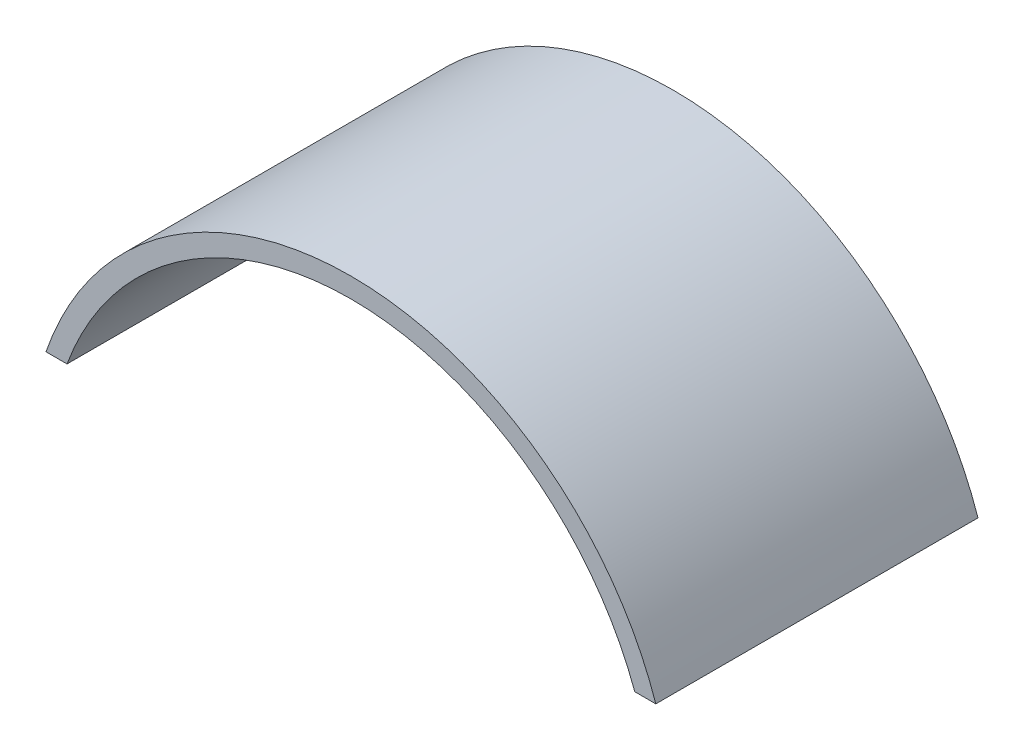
ISO-10303-21;
HEADER;
FILE_DESCRIPTION(('STEP AP214'),'2;1');
FILE_NAME('part.step','',(''),(''),'','','');
FILE_SCHEMA(('AUTOMOTIVE_DESIGN { 1 0 10303 214 1 1 1 1 }'));
ENDSEC;
DATA;
#1=APPLICATION_CONTEXT('core data for automotive mechanical design processes');
#2=APPLICATION_PROTOCOL_DEFINITION('international standard','automotive_design',2000,#1);
#3=PRODUCT_CONTEXT('',#1,'mechanical');
#4=PRODUCT('Part','Part','',(#3));
#5=PRODUCT_RELATED_PRODUCT_CATEGORY('part','',(#4));
#6=PRODUCT_DEFINITION_FORMATION('','',#4);
#7=PRODUCT_DEFINITION_CONTEXT('part definition',#1,'design');
#8=PRODUCT_DEFINITION('design','',#6,#7);
#9=PRODUCT_DEFINITION_SHAPE('','',#8);
#10=(LENGTH_UNIT() NAMED_UNIT(*) SI_UNIT(.MILLI.,.METRE.));
#11=(NAMED_UNIT(*) PLANE_ANGLE_UNIT() SI_UNIT($,.RADIAN.));
#12=(NAMED_UNIT(*) SI_UNIT($,.STERADIAN.) SOLID_ANGLE_UNIT());
#13=UNCERTAINTY_MEASURE_WITH_UNIT(LENGTH_MEASURE(1.E-05),#10,'distance_accuracy_value','');
#14=(GEOMETRIC_REPRESENTATION_CONTEXT(3) GLOBAL_UNCERTAINTY_ASSIGNED_CONTEXT((#13)) GLOBAL_UNIT_ASSIGNED_CONTEXT((#10,
#11,#12)) REPRESENTATION_CONTEXT('',''));
#15=CARTESIAN_POINT('',(0.,0.,0.));
#16=DIRECTION('',(0.,0.,1.));
#17=DIRECTION('',(1.,0.,0.));
#18=AXIS2_PLACEMENT_3D('',#15,#16,#17);
#19=CARTESIAN_POINT('',(0.,0.,130.));
#20=DIRECTION('',(0.,0.,-1.));
#21=DIRECTION('',(-1.,0.,0.));
#22=AXIS2_PLACEMENT_3D('',#19,#20,#21);
#23=CYLINDRICAL_SURFACE('',#22,130.);
#24=CARTESIAN_POINT('',(0.,0.,0.));
#25=DIRECTION('',(0.,0.,1.));
#26=DIRECTION('',(1.,0.,0.));
#27=AXIS2_PLACEMENT_3D('',#24,#25,#26);
#28=CIRCLE('',#27,130.);
#29=CARTESIAN_POINT('',(123.028451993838,42.,0.));
#30=VERTEX_POINT('',#29);
#31=CARTESIAN_POINT('',(-123.028451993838,42.,0.));
#32=VERTEX_POINT('',#31);
#33=EDGE_CURVE('E89',#30,#32,#28,.T.);
#34=ORIENTED_EDGE('',*,*,#33,.T.);
#35=DIRECTION('',(0.,0.,-1.));
#36=VECTOR('',#35,1.);
#37=CARTESIAN_POINT('',(-123.028451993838,42.,130.));
#38=LINE('',#37,#36);
#39=CARTESIAN_POINT('',(-123.028451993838,42.,130.));
#40=VERTEX_POINT('',#39);
#41=EDGE_CURVE('E11',#40,#32,#38,.T.);
#42=ORIENTED_EDGE('',*,*,#41,.F.);
#43=CARTESIAN_POINT('',(0.,0.,130.));
#44=DIRECTION('',(0.,0.,1.));
#45=DIRECTION('',(1.,0.,0.));
#46=AXIS2_PLACEMENT_3D('',#43,#44,#45);
#47=CIRCLE('',#46,130.);
#48=CARTESIAN_POINT('',(123.028451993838,42.,130.));
#49=VERTEX_POINT('',#48);
#50=EDGE_CURVE('E107',#49,#40,#47,.T.);
#51=ORIENTED_EDGE('',*,*,#50,.F.);
#52=DIRECTION('',(0.,0.,-1.));
#53=VECTOR('',#52,1.);
#54=CARTESIAN_POINT('',(123.028451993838,42.,130.));
#55=LINE('',#54,#53);
#56=EDGE_CURVE('E101',#49,#30,#55,.T.);
#57=ORIENTED_EDGE('',*,*,#56,.T.);
#58=EDGE_LOOP('',(#34,#42,#51,#57));
#59=FACE_BOUND('',#58,.T.);
#60=ADVANCED_FACE('F45',(#59),#23,.T.);
#61=CARTESIAN_POINT('',(-123.028451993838,42.,130.));
#62=DIRECTION('',(0.,1.,0.));
#63=DIRECTION('',(0.,0.,1.));
#64=AXIS2_PLACEMENT_3D('',#61,#62,#63);
#65=PLANE('',#64);
#66=DIRECTION('',(1.,0.,0.));
#67=VECTOR('',#66,1.);
#68=CARTESIAN_POINT('',(-123.028451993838,42.,0.));
#69=LINE('',#68,#67);
#70=CARTESIAN_POINT('',(-114.542568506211,42.,0.));
#71=VERTEX_POINT('',#70);
#72=EDGE_CURVE('E85',#32,#71,#69,.T.);
#73=ORIENTED_EDGE('',*,*,#72,.T.);
#74=DIRECTION('',(0.,0.,-1.));
#75=VECTOR('',#74,1.);
#76=CARTESIAN_POINT('',(-114.542568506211,42.,130.));
#77=LINE('',#76,#75);
#78=CARTESIAN_POINT('',(-114.542568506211,42.,130.));
#79=VERTEX_POINT('',#78);
#80=EDGE_CURVE('E52',#79,#71,#77,.T.);
#81=ORIENTED_EDGE('',*,*,#80,.F.);
#82=DIRECTION('',(1.,0.,0.));
#83=VECTOR('',#82,1.);
#84=CARTESIAN_POINT('',(-123.028451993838,42.,130.));
#85=LINE('',#84,#83);
#86=EDGE_CURVE('E97',#40,#79,#85,.T.);
#87=ORIENTED_EDGE('',*,*,#86,.F.);
#88=ORIENTED_EDGE('',*,*,#41,.T.);
#89=EDGE_LOOP('',(#73,#81,#87,#88));
#90=FACE_BOUND('',#89,.T.);
#91=ADVANCED_FACE('F96',(#90),#65,.F.);
#92=CARTESIAN_POINT('',(0.,0.,130.));
#93=DIRECTION('',(0.,0.,-1.));
#94=DIRECTION('',(-1.,0.,0.));
#95=AXIS2_PLACEMENT_3D('',#92,#93,#94);
#96=CYLINDRICAL_SURFACE('',#95,122.);
#97=CARTESIAN_POINT('',(0.,0.,0.));
#98=DIRECTION('',(0.,0.,-1.));
#99=DIRECTION('',(1.,0.,0.));
#100=AXIS2_PLACEMENT_3D('',#97,#98,#99);
#101=CIRCLE('',#100,122.);
#102=CARTESIAN_POINT('',(114.542568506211,42.,0.));
#103=VERTEX_POINT('',#102);
#104=EDGE_CURVE('E90',#71,#103,#101,.T.);
#105=ORIENTED_EDGE('',*,*,#104,.T.);
#106=DIRECTION('',(0.,0.,-1.));
#107=VECTOR('',#106,1.);
#108=CARTESIAN_POINT('',(114.542568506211,42.,130.));
#109=LINE('',#108,#107);
#110=CARTESIAN_POINT('',(114.542568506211,42.,130.));
#111=VERTEX_POINT('',#110);
#112=EDGE_CURVE('E113',#111,#103,#109,.T.);
#113=ORIENTED_EDGE('',*,*,#112,.F.);
#114=CARTESIAN_POINT('',(0.,0.,130.));
#115=DIRECTION('',(0.,0.,-1.));
#116=DIRECTION('',(1.,0.,0.));
#117=AXIS2_PLACEMENT_3D('',#114,#115,#116);
#118=CIRCLE('',#117,122.);
#119=EDGE_CURVE('E64',#79,#111,#118,.T.);
#120=ORIENTED_EDGE('',*,*,#119,.F.);
#121=ORIENTED_EDGE('',*,*,#80,.T.);
#122=EDGE_LOOP('',(#105,#113,#120,#121));
#123=FACE_BOUND('',#122,.T.);
#124=ADVANCED_FACE('F116',(#123),#96,.F.);
#125=CARTESIAN_POINT('',(114.542568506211,42.,130.));
#126=DIRECTION('',(0.,1.,0.));
#127=DIRECTION('',(0.,0.,1.));
#128=AXIS2_PLACEMENT_3D('',#125,#126,#127);
#129=PLANE('',#128);
#130=DIRECTION('',(1.,0.,0.));
#131=VECTOR('',#130,1.);
#132=CARTESIAN_POINT('',(114.542568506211,42.,0.));
#133=LINE('',#132,#131);
#134=EDGE_CURVE('E105',#103,#30,#133,.T.);
#135=ORIENTED_EDGE('',*,*,#134,.T.);
#136=ORIENTED_EDGE('',*,*,#56,.F.);
#137=DIRECTION('',(1.,0.,0.));
#138=VECTOR('',#137,1.);
#139=CARTESIAN_POINT('',(114.542568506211,42.,130.));
#140=LINE('',#139,#138);
#141=EDGE_CURVE('E59',#111,#49,#140,.T.);
#142=ORIENTED_EDGE('',*,*,#141,.F.);
#143=ORIENTED_EDGE('',*,*,#112,.T.);
#144=EDGE_LOOP('',(#135,#136,#142,#143));
#145=FACE_BOUND('',#144,.T.);
#146=ADVANCED_FACE('F118',(#145),#129,.F.);
#147=CARTESIAN_POINT('',(0.,0.,130.));
#148=DIRECTION('',(0.,0.,1.));
#149=DIRECTION('',(1.,0.,0.));
#150=AXIS2_PLACEMENT_3D('',#147,#148,#149);
#151=PLANE('',#150);
#152=ORIENTED_EDGE('',*,*,#50,.T.);
#153=ORIENTED_EDGE('',*,*,#86,.T.);
#154=ORIENTED_EDGE('',*,*,#119,.T.);
#155=ORIENTED_EDGE('',*,*,#141,.T.);
#156=EDGE_LOOP('',(#152,#153,#154,#155));
#157=FACE_BOUND('',#156,.T.);
#158=ADVANCED_FACE('F119',(#157),#151,.T.);
#159=CARTESIAN_POINT('',(0.,0.,0.));
#160=DIRECTION('',(0.,0.,1.));
#161=DIRECTION('',(1.,0.,0.));
#162=AXIS2_PLACEMENT_3D('',#159,#160,#161);
#163=PLANE('',#162);
#164=ORIENTED_EDGE('',*,*,#33,.F.);
#165=ORIENTED_EDGE('',*,*,#134,.F.);
#166=ORIENTED_EDGE('',*,*,#104,.F.);
#167=ORIENTED_EDGE('',*,*,#72,.F.);
#168=EDGE_LOOP('',(#164,#165,#166,#167));
#169=FACE_BOUND('',#168,.T.);
#170=ADVANCED_FACE('F86',(#169),#163,.F.);
#171=CLOSED_SHELL('',(#60,#91,#124,#146,#158,#170));
#172=MANIFOLD_SOLID_BREP('B2',#171);
#173=ADVANCED_BREP_SHAPE_REPRESENTATION('',(#18,#172),#14);
#174=SHAPE_DEFINITION_REPRESENTATION(#9,#173);
ENDSEC;
END-ISO-10303-21;
